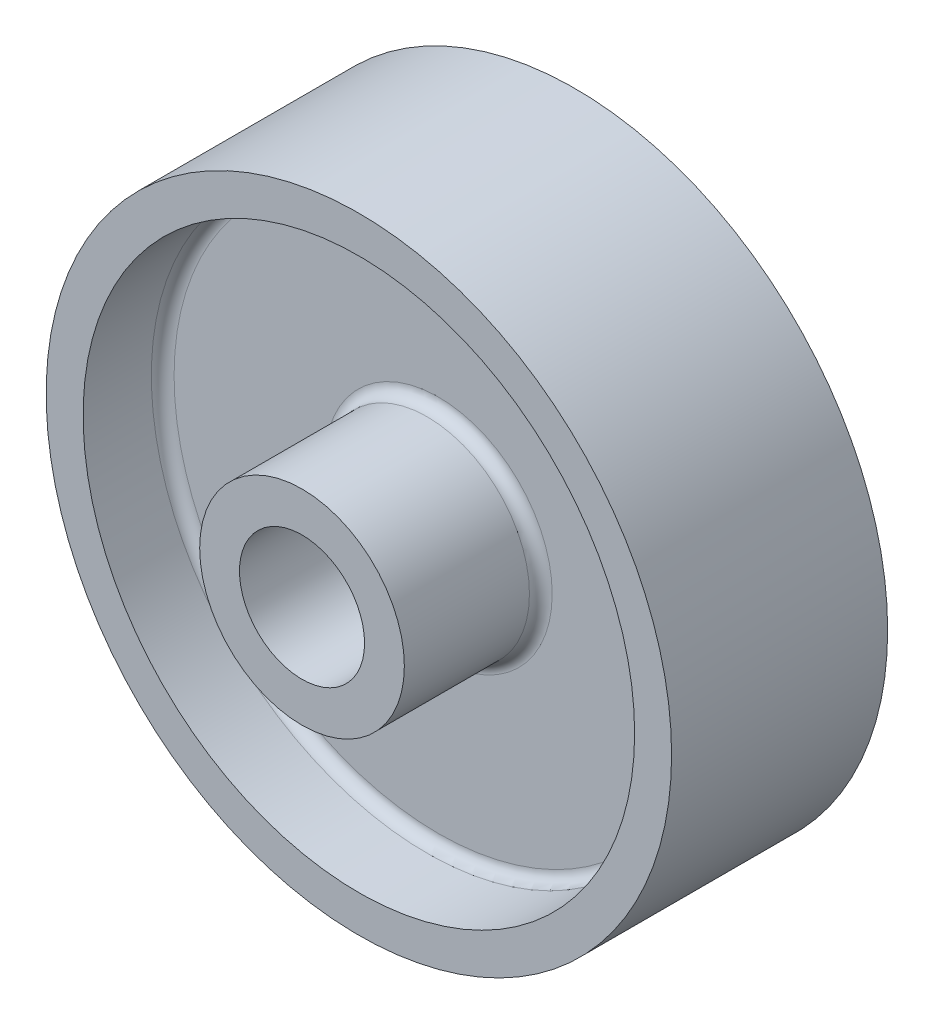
ISO-10303-21;
HEADER;
FILE_DESCRIPTION(('STEP AP214'),'2;1');
FILE_NAME('part.step','',(''),(''),'','','');
FILE_SCHEMA(('AUTOMOTIVE_DESIGN { 1 0 10303 214 1 1 1 1 }'));
ENDSEC;
DATA;
#1=APPLICATION_CONTEXT('core data for automotive mechanical design processes');
#2=APPLICATION_PROTOCOL_DEFINITION('international standard','automotive_design',2000,#1);
#3=PRODUCT_CONTEXT('',#1,'mechanical');
#4=PRODUCT('Part','Part','',(#3));
#5=PRODUCT_RELATED_PRODUCT_CATEGORY('part','',(#4));
#6=PRODUCT_DEFINITION_FORMATION('','',#4);
#7=PRODUCT_DEFINITION_CONTEXT('part definition',#1,'design');
#8=PRODUCT_DEFINITION('design','',#6,#7);
#9=PRODUCT_DEFINITION_SHAPE('','',#8);
#10=(LENGTH_UNIT() NAMED_UNIT(*) SI_UNIT(.MILLI.,.METRE.));
#11=(NAMED_UNIT(*) PLANE_ANGLE_UNIT() SI_UNIT($,.RADIAN.));
#12=(NAMED_UNIT(*) SI_UNIT($,.STERADIAN.) SOLID_ANGLE_UNIT());
#13=UNCERTAINTY_MEASURE_WITH_UNIT(LENGTH_MEASURE(1.E-05),#10,'distance_accuracy_value','');
#14=(GEOMETRIC_REPRESENTATION_CONTEXT(3) GLOBAL_UNCERTAINTY_ASSIGNED_CONTEXT((#13)) GLOBAL_UNIT_ASSIGNED_CONTEXT((#10,
#11,#12)) REPRESENTATION_CONTEXT('',''));
#15=CARTESIAN_POINT('',(0.,0.,0.));
#16=DIRECTION('',(0.,0.,1.));
#17=DIRECTION('',(1.,0.,0.));
#18=AXIS2_PLACEMENT_3D('',#15,#16,#17);
#19=CARTESIAN_POINT('',(0.,18.,29.));
#20=DIRECTION('',(0.,0.,-1.));
#21=DIRECTION('',(-1.,0.,0.));
#22=AXIS2_PLACEMENT_3D('',#19,#20,#21);
#23=PLANE('',#22);
#24=CARTESIAN_POINT('',(0.,0.,29.));
#25=DIRECTION('',(0.,0.,1.));
#26=DIRECTION('',(1.,0.,0.));
#27=AXIS2_PLACEMENT_3D('',#24,#25,#26);
#28=CIRCLE('',#27,11.);
#29=CARTESIAN_POINT('',(11.,0.,29.));
#30=VERTEX_POINT('',#29);
#31=EDGE_CURVE('E10',#30,#30,#28,.T.);
#32=ORIENTED_EDGE('',*,*,#31,.F.);
#33=EDGE_LOOP('',(#32));
#34=FACE_BOUND('',#33,.T.);
#35=CARTESIAN_POINT('',(0.,0.,29.));
#36=DIRECTION('',(0.,0.,1.));
#37=DIRECTION('',(1.,0.,0.));
#38=AXIS2_PLACEMENT_3D('',#35,#36,#37);
#39=CIRCLE('',#38,18.);
#40=CARTESIAN_POINT('',(18.,0.,29.));
#41=VERTEX_POINT('',#40);
#42=EDGE_CURVE('E83',#41,#41,#39,.T.);
#43=ORIENTED_EDGE('',*,*,#42,.T.);
#44=EDGE_LOOP('',(#43));
#45=FACE_BOUND('',#44,.T.);
#46=ADVANCED_FACE('F31',(#34,#45),#23,.F.);
#47=CARTESIAN_POINT('',(0.,0.,44.4601769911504));
#48=DIRECTION('',(0.,0.,1.));
#49=DIRECTION('',(1.,0.,0.));
#50=AXIS2_PLACEMENT_3D('',#47,#48,#49);
#51=CYLINDRICAL_SURFACE('',#50,11.);
#52=CARTESIAN_POINT('',(0.,0.,-29.));
#53=DIRECTION('',(0.,0.,1.));
#54=DIRECTION('',(1.,0.,0.));
#55=AXIS2_PLACEMENT_3D('',#52,#53,#54);
#56=CIRCLE('',#55,11.);
#57=CARTESIAN_POINT('',(11.,0.,-29.));
#58=VERTEX_POINT('',#57);
#59=EDGE_CURVE('E37',#58,#58,#56,.T.);
#60=ORIENTED_EDGE('',*,*,#59,.F.);
#61=EDGE_LOOP('',(#60));
#62=FACE_BOUND('',#61,.T.);
#63=ORIENTED_EDGE('',*,*,#31,.T.);
#64=EDGE_LOOP('',(#63));
#65=FACE_BOUND('',#64,.T.);
#66=ADVANCED_FACE('F168',(#62,#65),#51,.F.);
#67=CARTESIAN_POINT('',(0.,18.,-29.));
#68=DIRECTION('',(0.,0.,1.));
#69=DIRECTION('',(1.,0.,0.));
#70=AXIS2_PLACEMENT_3D('',#67,#68,#69);
#71=PLANE('',#70);
#72=CARTESIAN_POINT('',(0.,0.,-29.));
#73=DIRECTION('',(0.,0.,1.));
#74=DIRECTION('',(1.,0.,0.));
#75=AXIS2_PLACEMENT_3D('',#72,#73,#74);
#76=CIRCLE('',#75,18.);
#77=CARTESIAN_POINT('',(18.,0.,-29.));
#78=VERTEX_POINT('',#77);
#79=EDGE_CURVE('E41',#78,#78,#76,.T.);
#80=ORIENTED_EDGE('',*,*,#79,.F.);
#81=EDGE_LOOP('',(#80));
#82=FACE_BOUND('',#81,.T.);
#83=ORIENTED_EDGE('',*,*,#59,.T.);
#84=EDGE_LOOP('',(#83));
#85=FACE_BOUND('',#84,.T.);
#86=ADVANCED_FACE('F163',(#82,#85),#71,.F.);
#87=CARTESIAN_POINT('',(0.,0.,44.4601769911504));
#88=DIRECTION('',(0.,0.,1.));
#89=DIRECTION('',(1.,0.,0.));
#90=AXIS2_PLACEMENT_3D('',#87,#88,#89);
#91=CYLINDRICAL_SURFACE('',#90,18.);
#92=CARTESIAN_POINT('',(0.,0.,-7.00000000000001));
#93=DIRECTION('',(0.,0.,1.));
#94=DIRECTION('',(1.,0.,0.));
#95=AXIS2_PLACEMENT_3D('',#92,#93,#94);
#96=CIRCLE('',#95,18.);
#97=CARTESIAN_POINT('',(18.,0.,-7.00000000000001));
#98=VERTEX_POINT('',#97);
#99=EDGE_CURVE('E45',#98,#98,#96,.T.);
#100=ORIENTED_EDGE('',*,*,#99,.F.);
#101=EDGE_LOOP('',(#100));
#102=FACE_BOUND('',#101,.T.);
#103=ORIENTED_EDGE('',*,*,#79,.T.);
#104=EDGE_LOOP('',(#103));
#105=FACE_BOUND('',#104,.T.);
#106=ADVANCED_FACE('F157',(#102,#105),#91,.T.);
#107=CARTESIAN_POINT('',(0.,0.,-6.99999999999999));
#108=DIRECTION('',(0.,0.,1.));
#109=DIRECTION('',(1.,0.,0.));
#110=AXIS2_PLACEMENT_3D('',#107,#108,#109);
#111=TOROIDAL_SURFACE('',#110,20.,2.);
#112=CARTESIAN_POINT('',(0.,0.,-4.99999999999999));
#113=DIRECTION('',(0.,0.,1.));
#114=DIRECTION('',(1.,0.,0.));
#115=AXIS2_PLACEMENT_3D('',#112,#113,#114);
#116=CIRCLE('',#115,20.);
#117=CARTESIAN_POINT('',(20.,0.,-4.99999999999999));
#118=VERTEX_POINT('',#117);
#119=EDGE_CURVE('E50',#118,#118,#116,.T.);
#120=ORIENTED_EDGE('',*,*,#119,.F.);
#121=EDGE_LOOP('',(#120));
#122=FACE_BOUND('',#121,.T.);
#123=ORIENTED_EDGE('',*,*,#99,.T.);
#124=EDGE_LOOP('',(#123));
#125=FACE_BOUND('',#124,.T.);
#126=ADVANCED_FACE('F151',(#122,#125),#111,.F.);
#127=CARTESIAN_POINT('',(0.,46.5,-5.));
#128=DIRECTION('',(0.,0.,1.));
#129=DIRECTION('',(1.,0.,0.));
#130=AXIS2_PLACEMENT_3D('',#127,#128,#129);
#131=PLANE('',#130);
#132=CARTESIAN_POINT('',(0.,0.,-5.));
#133=DIRECTION('',(0.,0.,1.));
#134=DIRECTION('',(1.,0.,0.));
#135=AXIS2_PLACEMENT_3D('',#132,#133,#134);
#136=CIRCLE('',#135,46.5);
#137=CARTESIAN_POINT('',(46.5,0.,-5.));
#138=VERTEX_POINT('',#137);
#139=EDGE_CURVE('E53',#138,#138,#136,.T.);
#140=ORIENTED_EDGE('',*,*,#139,.F.);
#141=EDGE_LOOP('',(#140));
#142=FACE_BOUND('',#141,.T.);
#143=ORIENTED_EDGE('',*,*,#119,.T.);
#144=EDGE_LOOP('',(#143));
#145=FACE_BOUND('',#144,.T.);
#146=ADVANCED_FACE('F145',(#142,#145),#131,.F.);
#147=CARTESIAN_POINT('',(0.,0.,-7.));
#148=DIRECTION('',(0.,0.,1.));
#149=DIRECTION('',(1.,0.,0.));
#150=AXIS2_PLACEMENT_3D('',#147,#148,#149);
#151=TOROIDAL_SURFACE('',#150,46.5,2.);
#152=CARTESIAN_POINT('',(0.,0.,-7.00000000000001));
#153=DIRECTION('',(0.,0.,1.));
#154=DIRECTION('',(1.,0.,0.));
#155=AXIS2_PLACEMENT_3D('',#152,#153,#154);
#156=CIRCLE('',#155,48.5);
#157=CARTESIAN_POINT('',(48.5,0.,-7.00000000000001));
#158=VERTEX_POINT('',#157);
#159=EDGE_CURVE('E56',#158,#158,#156,.T.);
#160=ORIENTED_EDGE('',*,*,#159,.F.);
#161=EDGE_LOOP('',(#160));
#162=FACE_BOUND('',#161,.T.);
#163=ORIENTED_EDGE('',*,*,#139,.T.);
#164=EDGE_LOOP('',(#163));
#165=FACE_BOUND('',#164,.T.);
#166=ADVANCED_FACE('F139',(#162,#165),#151,.F.);
#167=CARTESIAN_POINT('',(0.,0.,44.4601769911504));
#168=DIRECTION('',(0.,0.,1.));
#169=DIRECTION('',(1.,0.,0.));
#170=AXIS2_PLACEMENT_3D('',#167,#168,#169);
#171=CYLINDRICAL_SURFACE('',#170,48.5);
#172=CARTESIAN_POINT('',(0.,0.,-19.));
#173=DIRECTION('',(0.,0.,1.));
#174=DIRECTION('',(1.,0.,0.));
#175=AXIS2_PLACEMENT_3D('',#172,#173,#174);
#176=CIRCLE('',#175,48.5);
#177=CARTESIAN_POINT('',(48.5,0.,-19.));
#178=VERTEX_POINT('',#177);
#179=EDGE_CURVE('E59',#178,#178,#176,.T.);
#180=ORIENTED_EDGE('',*,*,#179,.F.);
#181=EDGE_LOOP('',(#180));
#182=FACE_BOUND('',#181,.T.);
#183=ORIENTED_EDGE('',*,*,#159,.T.);
#184=EDGE_LOOP('',(#183));
#185=FACE_BOUND('',#184,.T.);
#186=ADVANCED_FACE('F133',(#182,#185),#171,.F.);
#187=CARTESIAN_POINT('',(0.,55.,-19.));
#188=DIRECTION('',(0.,0.,1.));
#189=DIRECTION('',(1.,0.,0.));
#190=AXIS2_PLACEMENT_3D('',#187,#188,#189);
#191=PLANE('',#190);
#192=CARTESIAN_POINT('',(0.,0.,-19.));
#193=DIRECTION('',(0.,0.,1.));
#194=DIRECTION('',(1.,0.,0.));
#195=AXIS2_PLACEMENT_3D('',#192,#193,#194);
#196=CIRCLE('',#195,55.);
#197=CARTESIAN_POINT('',(55.,0.,-19.));
#198=VERTEX_POINT('',#197);
#199=EDGE_CURVE('E62',#198,#198,#196,.T.);
#200=ORIENTED_EDGE('',*,*,#199,.F.);
#201=EDGE_LOOP('',(#200));
#202=FACE_BOUND('',#201,.T.);
#203=ORIENTED_EDGE('',*,*,#179,.T.);
#204=EDGE_LOOP('',(#203));
#205=FACE_BOUND('',#204,.T.);
#206=ADVANCED_FACE('F127',(#202,#205),#191,.F.);
#207=CARTESIAN_POINT('',(0.,0.,44.4601769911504));
#208=DIRECTION('',(0.,0.,1.));
#209=DIRECTION('',(1.,0.,0.));
#210=AXIS2_PLACEMENT_3D('',#207,#208,#209);
#211=CYLINDRICAL_SURFACE('',#210,55.);
#212=CARTESIAN_POINT('',(0.,0.,19.));
#213=DIRECTION('',(0.,0.,1.));
#214=DIRECTION('',(1.,0.,0.));
#215=AXIS2_PLACEMENT_3D('',#212,#213,#214);
#216=CIRCLE('',#215,55.);
#217=CARTESIAN_POINT('',(55.,0.,19.));
#218=VERTEX_POINT('',#217);
#219=EDGE_CURVE('E65',#218,#218,#216,.T.);
#220=ORIENTED_EDGE('',*,*,#219,.F.);
#221=EDGE_LOOP('',(#220));
#222=FACE_BOUND('',#221,.T.);
#223=ORIENTED_EDGE('',*,*,#199,.T.);
#224=EDGE_LOOP('',(#223));
#225=FACE_BOUND('',#224,.T.);
#226=ADVANCED_FACE('F121',(#222,#225),#211,.T.);
#227=CARTESIAN_POINT('',(0.,48.5,19.));
#228=DIRECTION('',(0.,0.,-1.));
#229=DIRECTION('',(-1.,0.,0.));
#230=AXIS2_PLACEMENT_3D('',#227,#228,#229);
#231=PLANE('',#230);
#232=CARTESIAN_POINT('',(0.,0.,19.));
#233=DIRECTION('',(0.,0.,1.));
#234=DIRECTION('',(1.,0.,0.));
#235=AXIS2_PLACEMENT_3D('',#232,#233,#234);
#236=CIRCLE('',#235,48.5);
#237=CARTESIAN_POINT('',(48.5,0.,19.));
#238=VERTEX_POINT('',#237);
#239=EDGE_CURVE('E68',#238,#238,#236,.T.);
#240=ORIENTED_EDGE('',*,*,#239,.F.);
#241=EDGE_LOOP('',(#240));
#242=FACE_BOUND('',#241,.T.);
#243=ORIENTED_EDGE('',*,*,#219,.T.);
#244=EDGE_LOOP('',(#243));
#245=FACE_BOUND('',#244,.T.);
#246=ADVANCED_FACE('F115',(#242,#245),#231,.F.);
#247=CARTESIAN_POINT('',(0.,0.,44.4601769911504));
#248=DIRECTION('',(0.,0.,1.));
#249=DIRECTION('',(1.,0.,0.));
#250=AXIS2_PLACEMENT_3D('',#247,#248,#249);
#251=CYLINDRICAL_SURFACE('',#250,48.5);
#252=CARTESIAN_POINT('',(0.,0.,7.00000000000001));
#253=DIRECTION('',(0.,0.,1.));
#254=DIRECTION('',(1.,0.,0.));
#255=AXIS2_PLACEMENT_3D('',#252,#253,#254);
#256=CIRCLE('',#255,48.5);
#257=CARTESIAN_POINT('',(48.5,0.,7.00000000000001));
#258=VERTEX_POINT('',#257);
#259=EDGE_CURVE('E71',#258,#258,#256,.T.);
#260=ORIENTED_EDGE('',*,*,#259,.F.);
#261=EDGE_LOOP('',(#260));
#262=FACE_BOUND('',#261,.T.);
#263=ORIENTED_EDGE('',*,*,#239,.T.);
#264=EDGE_LOOP('',(#263));
#265=FACE_BOUND('',#264,.T.);
#266=ADVANCED_FACE('F109',(#262,#265),#251,.F.);
#267=CARTESIAN_POINT('',(0.,0.,7.));
#268=DIRECTION('',(0.,0.,1.));
#269=DIRECTION('',(1.,0.,0.));
#270=AXIS2_PLACEMENT_3D('',#267,#268,#269);
#271=TOROIDAL_SURFACE('',#270,46.5,2.);
#272=CARTESIAN_POINT('',(0.,0.,5.));
#273=DIRECTION('',(0.,0.,1.));
#274=DIRECTION('',(1.,0.,0.));
#275=AXIS2_PLACEMENT_3D('',#272,#273,#274);
#276=CIRCLE('',#275,46.5);
#277=CARTESIAN_POINT('',(46.5,0.,5.));
#278=VERTEX_POINT('',#277);
#279=EDGE_CURVE('E74',#278,#278,#276,.T.);
#280=ORIENTED_EDGE('',*,*,#279,.F.);
#281=EDGE_LOOP('',(#280));
#282=FACE_BOUND('',#281,.T.);
#283=ORIENTED_EDGE('',*,*,#259,.T.);
#284=EDGE_LOOP('',(#283));
#285=FACE_BOUND('',#284,.T.);
#286=ADVANCED_FACE('F103',(#282,#285),#271,.F.);
#287=CARTESIAN_POINT('',(0.,46.5,4.99999999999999));
#288=DIRECTION('',(0.,0.,-1.));
#289=DIRECTION('',(-1.,0.,0.));
#290=AXIS2_PLACEMENT_3D('',#287,#288,#289);
#291=PLANE('',#290);
#292=CARTESIAN_POINT('',(0.,0.,4.99999999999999));
#293=DIRECTION('',(0.,0.,1.));
#294=DIRECTION('',(1.,0.,0.));
#295=AXIS2_PLACEMENT_3D('',#292,#293,#294);
#296=CIRCLE('',#295,20.);
#297=CARTESIAN_POINT('',(20.,0.,4.99999999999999));
#298=VERTEX_POINT('',#297);
#299=EDGE_CURVE('E77',#298,#298,#296,.T.);
#300=ORIENTED_EDGE('',*,*,#299,.F.);
#301=EDGE_LOOP('',(#300));
#302=FACE_BOUND('',#301,.T.);
#303=ORIENTED_EDGE('',*,*,#279,.T.);
#304=EDGE_LOOP('',(#303));
#305=FACE_BOUND('',#304,.T.);
#306=ADVANCED_FACE('F97',(#302,#305),#291,.F.);
#307=CARTESIAN_POINT('',(0.,0.,6.99999999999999));
#308=DIRECTION('',(0.,0.,1.));
#309=DIRECTION('',(1.,0.,0.));
#310=AXIS2_PLACEMENT_3D('',#307,#308,#309);
#311=TOROIDAL_SURFACE('',#310,20.,2.);
#312=CARTESIAN_POINT('',(0.,0.,7.00000000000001));
#313=DIRECTION('',(0.,0.,1.));
#314=DIRECTION('',(1.,0.,0.));
#315=AXIS2_PLACEMENT_3D('',#312,#313,#314);
#316=CIRCLE('',#315,18.);
#317=CARTESIAN_POINT('',(18.,0.,7.00000000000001));
#318=VERTEX_POINT('',#317);
#319=EDGE_CURVE('E80',#318,#318,#316,.T.);
#320=ORIENTED_EDGE('',*,*,#319,.F.);
#321=EDGE_LOOP('',(#320));
#322=FACE_BOUND('',#321,.T.);
#323=ORIENTED_EDGE('',*,*,#299,.T.);
#324=EDGE_LOOP('',(#323));
#325=FACE_BOUND('',#324,.T.);
#326=ADVANCED_FACE('F91',(#322,#325),#311,.F.);
#327=CARTESIAN_POINT('',(0.,0.,44.4601769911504));
#328=DIRECTION('',(0.,0.,1.));
#329=DIRECTION('',(1.,0.,0.));
#330=AXIS2_PLACEMENT_3D('',#327,#328,#329);
#331=CYLINDRICAL_SURFACE('',#330,18.);
#332=ORIENTED_EDGE('',*,*,#42,.F.);
#333=EDGE_LOOP('',(#332));
#334=FACE_BOUND('',#333,.T.);
#335=ORIENTED_EDGE('',*,*,#319,.T.);
#336=EDGE_LOOP('',(#335));
#337=FACE_BOUND('',#336,.T.);
#338=ADVANCED_FACE('F88',(#334,#337),#331,.T.);
#339=CLOSED_SHELL('',(#46,#66,#86,#106,#126,#146,#166,#186,#206,#226,#246,#266,#286,#306,#326,#338));
#340=MANIFOLD_SOLID_BREP('B2',#339);
#341=ADVANCED_BREP_SHAPE_REPRESENTATION('',(#18,#340),#14);
#342=SHAPE_DEFINITION_REPRESENTATION(#9,#341);
ENDSEC;
END-ISO-10303-21;
